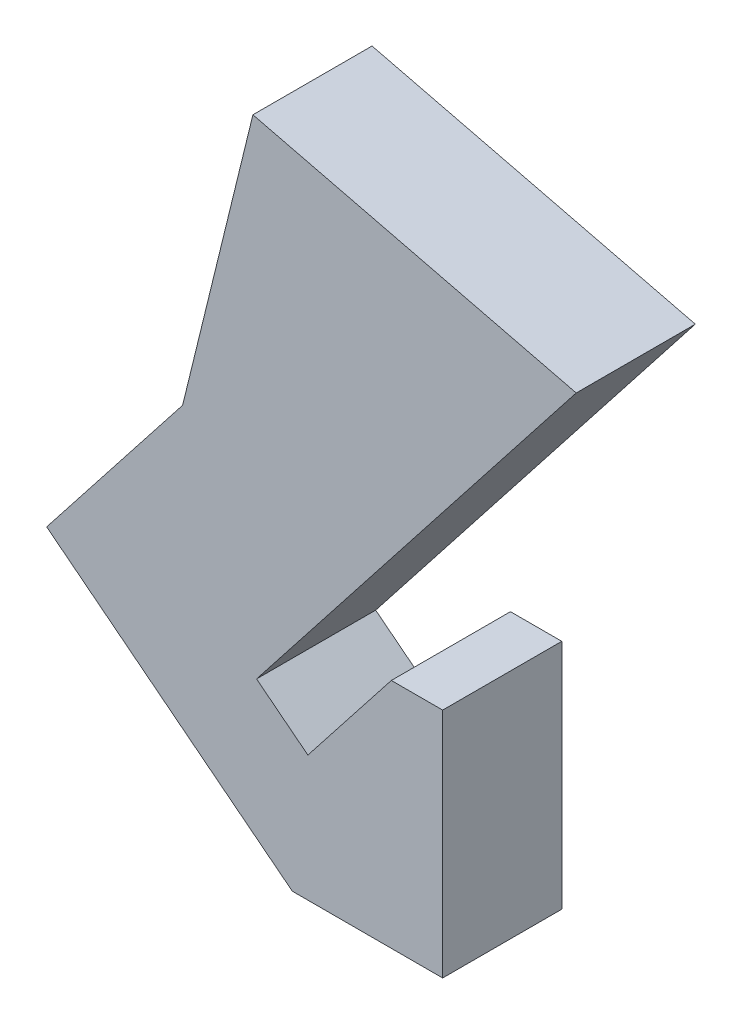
from build123d import *

# Parameters (mm, degrees)
EXTRUDE1_DEPTH = 5.842


with BuildPart() as part:
    # Sketch1 → Extrude1 (new body)
    with BuildSketch(Plane.XY):
        Polygon((0, 0), (-7.374487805, 0), (-19.420523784, 9.449373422), (-12.75318635, 17.948877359), (-9.305834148, 32.010464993), (6.549706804, 28.123305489), (-9.127190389, 8.138438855), (-6.609097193, 6.163149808), (-2.517427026, 11.3792), (0, 11.3792), align=None)
    extrude(amount=EXTRUDE1_DEPTH)


solid = part.part
